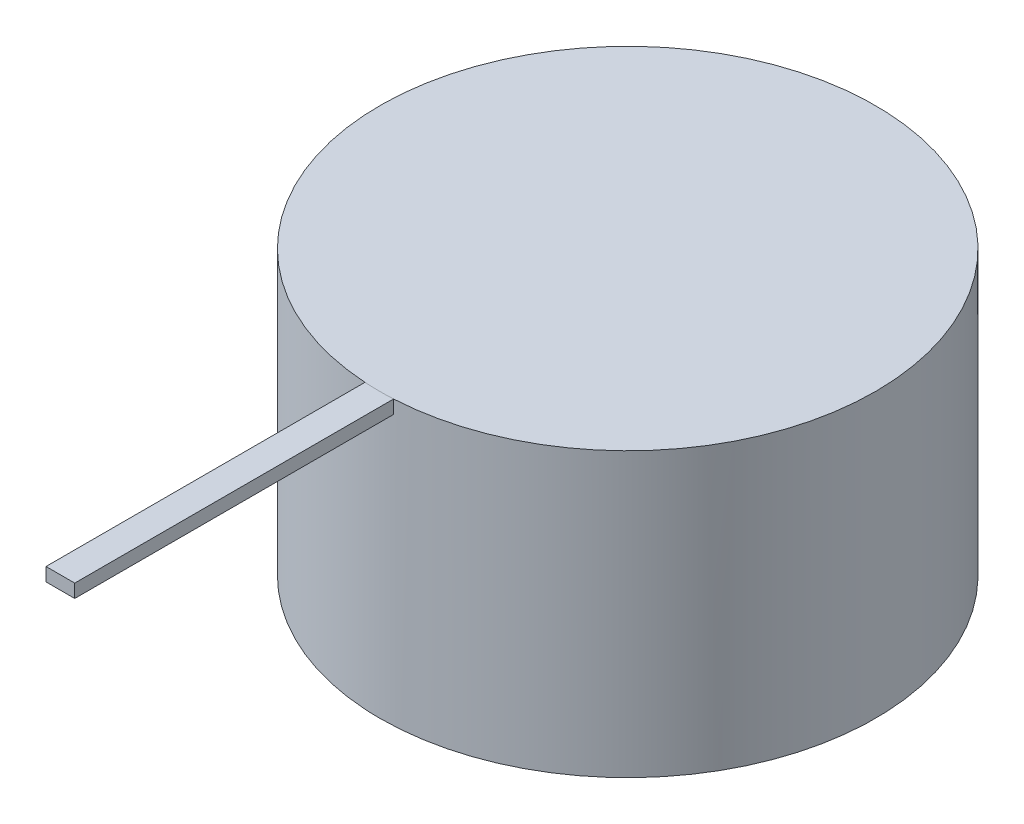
ISO-10303-21;
HEADER;
FILE_DESCRIPTION(('STEP AP214'),'2;1');
FILE_NAME('part.step','',(''),(''),'','','');
FILE_SCHEMA(('AUTOMOTIVE_DESIGN { 1 0 10303 214 1 1 1 1 }'));
ENDSEC;
DATA;
#1=APPLICATION_CONTEXT('core data for automotive mechanical design processes');
#2=APPLICATION_PROTOCOL_DEFINITION('international standard','automotive_design',2000,#1);
#3=PRODUCT_CONTEXT('',#1,'mechanical');
#4=PRODUCT('Part','Part','',(#3));
#5=PRODUCT_RELATED_PRODUCT_CATEGORY('part','',(#4));
#6=PRODUCT_DEFINITION_FORMATION('','',#4);
#7=PRODUCT_DEFINITION_CONTEXT('part definition',#1,'design');
#8=PRODUCT_DEFINITION('design','',#6,#7);
#9=PRODUCT_DEFINITION_SHAPE('','',#8);
#10=(LENGTH_UNIT() NAMED_UNIT(*) SI_UNIT(.MILLI.,.METRE.));
#11=(NAMED_UNIT(*) PLANE_ANGLE_UNIT() SI_UNIT($,.RADIAN.));
#12=(NAMED_UNIT(*) SI_UNIT($,.STERADIAN.) SOLID_ANGLE_UNIT());
#13=UNCERTAINTY_MEASURE_WITH_UNIT(LENGTH_MEASURE(1.E-05),#10,'distance_accuracy_value','');
#14=(GEOMETRIC_REPRESENTATION_CONTEXT(3) GLOBAL_UNCERTAINTY_ASSIGNED_CONTEXT((#13)) GLOBAL_UNIT_ASSIGNED_CONTEXT((#10,
#11,#12)) REPRESENTATION_CONTEXT('',''));
#15=CARTESIAN_POINT('',(0.,0.,0.));
#16=DIRECTION('',(0.,0.,1.));
#17=DIRECTION('',(1.,0.,0.));
#18=AXIS2_PLACEMENT_3D('',#15,#16,#17);
#19=CARTESIAN_POINT('',(0.,6.29793,0.));
#20=DIRECTION('',(0.,1.,0.));
#21=DIRECTION('',(0.,0.,1.));
#22=AXIS2_PLACEMENT_3D('',#19,#20,#21);
#23=PLANE('',#22);
#24=DIRECTION('',(0.,0.,-1.));
#25=VECTOR('',#24,1.);
#26=CARTESIAN_POINT('',(0.237482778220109,6.29793,10.16));
#27=LINE('',#26,#25);
#28=CARTESIAN_POINT('',(0.237482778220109,6.29793,10.16));
#29=VERTEX_POINT('',#28);
#30=CARTESIAN_POINT('',(0.237482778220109,6.29793,4.43865147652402));
#31=VERTEX_POINT('',#30);
#32=EDGE_CURVE('E93',#29,#31,#27,.T.);
#33=ORIENTED_EDGE('',*,*,#32,.T.);
#34=CARTESIAN_POINT('',(0.,6.29793,0.));
#35=DIRECTION('',(0.,1.,0.));
#36=DIRECTION('',(0.,0.,1.));
#37=AXIS2_PLACEMENT_3D('',#34,#35,#36);
#38=CIRCLE('',#37,4.445);
#39=CARTESIAN_POINT('',(-0.278194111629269,6.29793,4.43628595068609));
#40=VERTEX_POINT('',#39);
#41=EDGE_CURVE('E11',#31,#40,#38,.F.);
#42=ORIENTED_EDGE('',*,*,#41,.T.);
#43=DIRECTION('',(0.,0.,-1.));
#44=VECTOR('',#43,1.);
#45=CARTESIAN_POINT('',(-0.278194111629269,6.29793,10.16));
#46=LINE('',#45,#44);
#47=CARTESIAN_POINT('',(-0.278194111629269,6.29793,10.16));
#48=VERTEX_POINT('',#47);
#49=EDGE_CURVE('E134',#48,#40,#46,.T.);
#50=ORIENTED_EDGE('',*,*,#49,.F.);
#51=DIRECTION('',(-1.,0.,0.));
#52=VECTOR('',#51,1.);
#53=CARTESIAN_POINT('',(-0.278194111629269,6.29793,10.16));
#54=LINE('',#53,#52);
#55=EDGE_CURVE('E83',#29,#48,#54,.T.);
#56=ORIENTED_EDGE('',*,*,#55,.F.);
#57=EDGE_LOOP('',(#33,#42,#50,#56));
#58=FACE_BOUND('',#57,.T.);
#59=ADVANCED_FACE('F28',(#58),#23,.T.);
#60=CARTESIAN_POINT('',(0.,6.29793,0.));
#61=DIRECTION('',(0.,-1.,0.));
#62=DIRECTION('',(0.,0.,-1.));
#63=AXIS2_PLACEMENT_3D('',#60,#61,#62);
#64=CYLINDRICAL_SURFACE('',#63,4.445);
#65=CARTESIAN_POINT('',(0.,1.21793,0.));
#66=DIRECTION('',(0.,1.,0.));
#67=DIRECTION('',(0.,0.,1.));
#68=AXIS2_PLACEMENT_3D('',#65,#66,#67);
#69=CIRCLE('',#68,4.445);
#70=CARTESIAN_POINT('',(0.,1.21793,4.445));
#71=VERTEX_POINT('',#70);
#72=EDGE_CURVE('E98',#71,#71,#69,.T.);
#73=ORIENTED_EDGE('',*,*,#72,.T.);
#74=EDGE_LOOP('',(#73));
#75=FACE_BOUND('',#74,.T.);
#76=DIRECTION('',(0.,-1.,0.));
#77=VECTOR('',#76,1.);
#78=CARTESIAN_POINT('',(-0.278194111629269,6.29793,4.43628595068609));
#79=LINE('',#78,#77);
#80=CARTESIAN_POINT('',(-0.278194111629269,6.05812033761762,4.43628595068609));
#81=VERTEX_POINT('',#80);
#82=EDGE_CURVE('E88',#40,#81,#79,.T.);
#83=ORIENTED_EDGE('',*,*,#82,.F.);
#84=CARTESIAN_POINT('',(0.,6.29793,0.));
#85=DIRECTION('',(0.,1.,0.));
#86=DIRECTION('',(0.,0.,1.));
#87=AXIS2_PLACEMENT_3D('',#84,#85,#86);
#88=CIRCLE('',#87,4.445);
#89=EDGE_CURVE('E101',#31,#40,#88,.T.);
#90=ORIENTED_EDGE('',*,*,#89,.F.);
#91=DIRECTION('',(0.,-1.,0.));
#92=VECTOR('',#91,1.);
#93=CARTESIAN_POINT('',(0.237482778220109,6.29793,4.43865147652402));
#94=LINE('',#93,#92);
#95=CARTESIAN_POINT('',(0.237482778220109,6.05812033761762,4.43865147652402));
#96=VERTEX_POINT('',#95);
#97=EDGE_CURVE('E89',#96,#31,#94,.F.);
#98=ORIENTED_EDGE('',*,*,#97,.F.);
#99=CARTESIAN_POINT('',(0.,6.05812033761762,0.));
#100=DIRECTION('',(0.,1.,0.));
#101=DIRECTION('',(0.,0.,1.));
#102=AXIS2_PLACEMENT_3D('',#99,#100,#101);
#103=CIRCLE('',#102,4.445);
#104=EDGE_CURVE('E37',#81,#96,#103,.T.);
#105=ORIENTED_EDGE('',*,*,#104,.F.);
#106=EDGE_LOOP('',(#83,#90,#98,#105));
#107=FACE_BOUND('',#106,.T.);
#108=ADVANCED_FACE('F114',(#75,#107),#64,.T.);
#109=CARTESIAN_POINT('',(0.,1.21793,0.));
#110=DIRECTION('',(0.,-1.,0.));
#111=DIRECTION('',(0.,0.,-1.));
#112=AXIS2_PLACEMENT_3D('',#109,#110,#111);
#113=CYLINDRICAL_SURFACE('',#112,2.29235);
#114=CARTESIAN_POINT('',(0.,1.21793,0.));
#115=DIRECTION('',(0.,1.,0.));
#116=DIRECTION('',(0.,0.,1.));
#117=AXIS2_PLACEMENT_3D('',#114,#115,#116);
#118=CIRCLE('',#117,2.29235);
#119=CARTESIAN_POINT('',(0.,1.21793,2.29235));
#120=VERTEX_POINT('',#119);
#121=EDGE_CURVE('E106',#120,#120,#118,.T.);
#122=ORIENTED_EDGE('',*,*,#121,.F.);
#123=EDGE_LOOP('',(#122));
#124=FACE_BOUND('',#123,.T.);
#125=CARTESIAN_POINT('',(0.,0.,0.));
#126=DIRECTION('',(0.,1.,0.));
#127=DIRECTION('',(0.,0.,1.));
#128=AXIS2_PLACEMENT_3D('',#125,#126,#127);
#129=CIRCLE('',#128,2.29235);
#130=CARTESIAN_POINT('',(0.,0.,2.29235));
#131=VERTEX_POINT('',#130);
#132=EDGE_CURVE('E103',#131,#131,#129,.T.);
#133=ORIENTED_EDGE('',*,*,#132,.T.);
#134=EDGE_LOOP('',(#133));
#135=FACE_BOUND('',#134,.T.);
#136=ADVANCED_FACE('F30',(#124,#135),#113,.T.);
#137=CARTESIAN_POINT('',(0.,0.,0.));
#138=DIRECTION('',(0.,1.,0.));
#139=DIRECTION('',(0.,0.,1.));
#140=AXIS2_PLACEMENT_3D('',#137,#138,#139);
#141=PLANE('',#140);
#142=ORIENTED_EDGE('',*,*,#132,.F.);
#143=EDGE_LOOP('',(#142));
#144=FACE_BOUND('',#143,.T.);
#145=ADVANCED_FACE('F125',(#144),#141,.F.);
#146=CARTESIAN_POINT('',(0.,1.21793,0.));
#147=DIRECTION('',(0.,1.,0.));
#148=DIRECTION('',(0.,0.,1.));
#149=AXIS2_PLACEMENT_3D('',#146,#147,#148);
#150=PLANE('',#149);
#151=ORIENTED_EDGE('',*,*,#72,.F.);
#152=EDGE_LOOP('',(#151));
#153=FACE_BOUND('',#152,.T.);
#154=ORIENTED_EDGE('',*,*,#121,.T.);
#155=EDGE_LOOP('',(#154));
#156=FACE_BOUND('',#155,.T.);
#157=ADVANCED_FACE('F117',(#153,#156),#150,.F.);
#158=ORIENTED_EDGE('',*,*,#41,.F.);
#159=ORIENTED_EDGE('',*,*,#89,.T.);
#160=EDGE_LOOP('',(#158,#159));
#161=FACE_BOUND('',#160,.T.);
#162=ADVANCED_FACE('F115',(#161),#23,.T.);
#163=CARTESIAN_POINT('',(-0.278194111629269,6.05812033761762,10.16));
#164=DIRECTION('',(0.,1.,0.));
#165=DIRECTION('',(0.,0.,1.));
#166=AXIS2_PLACEMENT_3D('',#163,#164,#165);
#167=PLANE('',#166);
#168=DIRECTION('',(0.,0.,-1.));
#169=VECTOR('',#168,1.);
#170=CARTESIAN_POINT('',(-0.278194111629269,6.05812033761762,10.16));
#171=LINE('',#170,#169);
#172=CARTESIAN_POINT('',(-0.278194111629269,6.05812033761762,10.16));
#173=VERTEX_POINT('',#172);
#174=EDGE_CURVE('E71',#173,#81,#171,.T.);
#175=ORIENTED_EDGE('',*,*,#174,.T.);
#176=ORIENTED_EDGE('',*,*,#104,.T.);
#177=DIRECTION('',(0.,0.,-1.));
#178=VECTOR('',#177,1.);
#179=CARTESIAN_POINT('',(0.237482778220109,6.05812033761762,10.16));
#180=LINE('',#179,#178);
#181=CARTESIAN_POINT('',(0.237482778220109,6.05812033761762,10.16));
#182=VERTEX_POINT('',#181);
#183=EDGE_CURVE('E74',#182,#96,#180,.T.);
#184=ORIENTED_EDGE('',*,*,#183,.F.);
#185=DIRECTION('',(1.,0.,0.));
#186=VECTOR('',#185,1.);
#187=CARTESIAN_POINT('',(-0.278194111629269,6.05812033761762,10.16));
#188=LINE('',#187,#186);
#189=EDGE_CURVE('E67',#173,#182,#188,.T.);
#190=ORIENTED_EDGE('',*,*,#189,.F.);
#191=EDGE_LOOP('',(#175,#176,#184,#190));
#192=FACE_BOUND('',#191,.T.);
#193=ADVANCED_FACE('F69',(#192),#167,.F.);
#194=CARTESIAN_POINT('',(-0.278194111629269,6.29793,10.16));
#195=DIRECTION('',(1.,0.,0.));
#196=DIRECTION('',(0.,1.,0.));
#197=AXIS2_PLACEMENT_3D('',#194,#195,#196);
#198=PLANE('',#197);
#199=ORIENTED_EDGE('',*,*,#49,.T.);
#200=ORIENTED_EDGE('',*,*,#82,.T.);
#201=ORIENTED_EDGE('',*,*,#174,.F.);
#202=DIRECTION('',(0.,-1.,0.));
#203=VECTOR('',#202,1.);
#204=CARTESIAN_POINT('',(-0.278194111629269,6.29793,10.16));
#205=LINE('',#204,#203);
#206=EDGE_CURVE('E78',#48,#173,#205,.T.);
#207=ORIENTED_EDGE('',*,*,#206,.F.);
#208=EDGE_LOOP('',(#199,#200,#201,#207));
#209=FACE_BOUND('',#208,.T.);
#210=ADVANCED_FACE('F86',(#209),#198,.F.);
#211=CARTESIAN_POINT('',(0.237482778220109,6.29793,10.16));
#212=DIRECTION('',(-1.,0.,0.));
#213=DIRECTION('',(0.,-1.,0.));
#214=AXIS2_PLACEMENT_3D('',#211,#212,#213);
#215=PLANE('',#214);
#216=ORIENTED_EDGE('',*,*,#183,.T.);
#217=ORIENTED_EDGE('',*,*,#97,.T.);
#218=ORIENTED_EDGE('',*,*,#32,.F.);
#219=DIRECTION('',(0.,1.,0.));
#220=VECTOR('',#219,1.);
#221=CARTESIAN_POINT('',(0.237482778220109,6.29793,10.16));
#222=LINE('',#221,#220);
#223=EDGE_CURVE('E77',#182,#29,#222,.T.);
#224=ORIENTED_EDGE('',*,*,#223,.F.);
#225=EDGE_LOOP('',(#216,#217,#218,#224));
#226=FACE_BOUND('',#225,.T.);
#227=ADVANCED_FACE('F111',(#226),#215,.F.);
#228=CARTESIAN_POINT('',(-0.278194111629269,6.05812033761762,10.16));
#229=DIRECTION('',(0.,0.,1.));
#230=DIRECTION('',(1.,0.,0.));
#231=AXIS2_PLACEMENT_3D('',#228,#229,#230);
#232=PLANE('',#231);
#233=ORIENTED_EDGE('',*,*,#206,.T.);
#234=ORIENTED_EDGE('',*,*,#189,.T.);
#235=ORIENTED_EDGE('',*,*,#223,.T.);
#236=ORIENTED_EDGE('',*,*,#55,.T.);
#237=EDGE_LOOP('',(#233,#234,#235,#236));
#238=FACE_BOUND('',#237,.T.);
#239=ADVANCED_FACE('F81',(#238),#232,.T.);
#240=CLOSED_SHELL('',(#59,#108,#136,#145,#157,#162,#193,#210,#227,#239));
#241=MANIFOLD_SOLID_BREP('B2',#240);
#242=ADVANCED_BREP_SHAPE_REPRESENTATION('',(#18,#241),#14);
#243=SHAPE_DEFINITION_REPRESENTATION(#9,#242);
ENDSEC;
END-ISO-10303-21;
